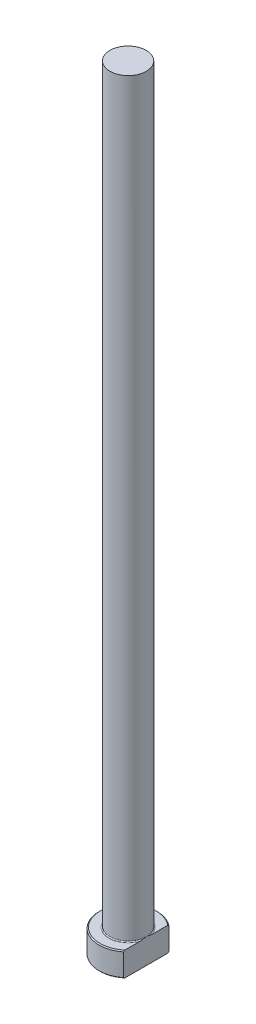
from build123d import *
from build123d.topology import SkipClean

# Parameters (mm, degrees)
CHAMFER1_SIZE = 0.2
FILLET1_R     = 0.2
KEY_DEPTH     = 161.224842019


with BuildPart() as part:
    # Sketch1 → Revolve1 (revolve)
    with BuildSketch(Plane.XY, mode=Mode.PRIVATE) as revolve1_sk:
        Polygon((0, 0), (-6, 0), (-6, 5), (-3.75, 5), (-3.75, 160), (0, 160), align=None)
    revolve(revolve1_sk.sketch.rotate(Axis((0, 259.958771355, 0), (0, -1, 0)), 270), axis=Axis((0, 259.958771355, 0), (0, -1, 0)))

    # Chamfer1
    chamfer1_edges = [part.edges().sort_by_distance(p)[0] for p in [
        (0, 5, -6),
        (0, 0, -6),
    ]]
    chamfer(chamfer1_edges, length=CHAMFER1_SIZE)

    # Fillet1
    fillet1_edges = [part.edges().sort_by_distance(p)[0] for p in [
        (0, 5, -3.75),
    ]]
    fillet(fillet1_edges, radius=FILLET1_R)

    # Sketch2 → KEY (cut, through all)
    with SkipClean():  # the faces are left unmerged after this step: merging them gives an invalid solid
        with BuildSketch(Plane(origin=(0, 0, 0), x_dir=(1, 0, 0), z_dir=(0, 1, 0))):
            with BuildLine():
                Line((3.75, 4.683748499), (3.75, -4.683748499))
                ThreePointArc((3.75, -4.683748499), (6, 0), (3.75, 4.683748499))
            make_face()
        extrude(amount=KEY_DEPTH, mode=Mode.SUBTRACT)


solid = part.part
